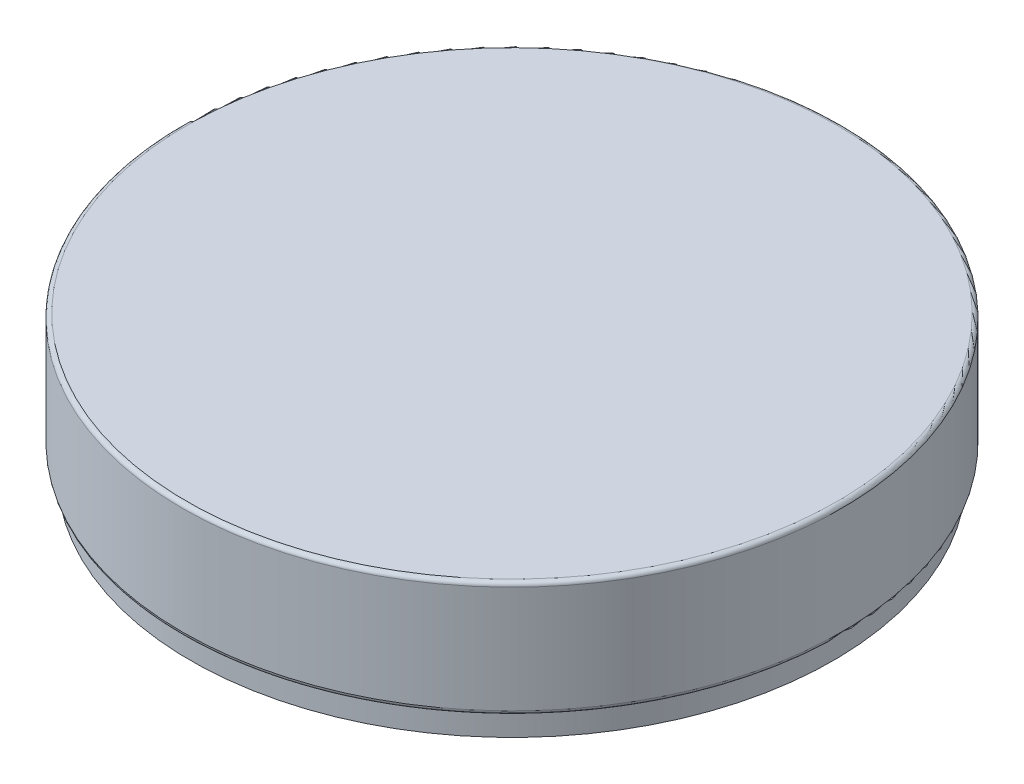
from build123d import *

# Parameters (mm, degrees)
CROQUIS2_R            = 190
CORTAR_EXTRUIR1_DEPTH = 10


with BuildPart() as part:
    # Croquis1 → Revoluci_n1 (revolve)
    with BuildSketch(Plane.XY, mode=Mode.PRIVATE) as revoluci_n1_sk:
        with BuildLine():
            Line((0, 0), (195, 0))
            Line((195, 0), (195, 15))
            Line((195, 15), (197.5, 15))
            ThreePointArc((197.5, 15), (199.267766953, 15.732233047), (200, 17.5))
            Line((200, 17.5), (200, 82.5))
            ThreePointArc((200, 82.5), (199.267766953, 84.267766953), (197.5, 85))
            Line((197.5, 85), (0, 85))
            Line((0, 85), (0, 0))
        make_face()
    revolve(revoluci_n1_sk.sketch.rotate(Axis((0, -14.306453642, 0), (0, 1, 0)), 90), axis=Axis((0, -14.306453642, 0), (0, 1, 0)))

    # Croquis2 → Cortar-Extruir1 (cut)
    with BuildSketch(Plane.XZ):
        with Locations(Location((0, 0, 0), (0, 0, 270))):
            Circle(CROQUIS2_R)
    extrude(amount=-CORTAR_EXTRUIR1_DEPTH, mode=Mode.SUBTRACT)


solid = part.part
